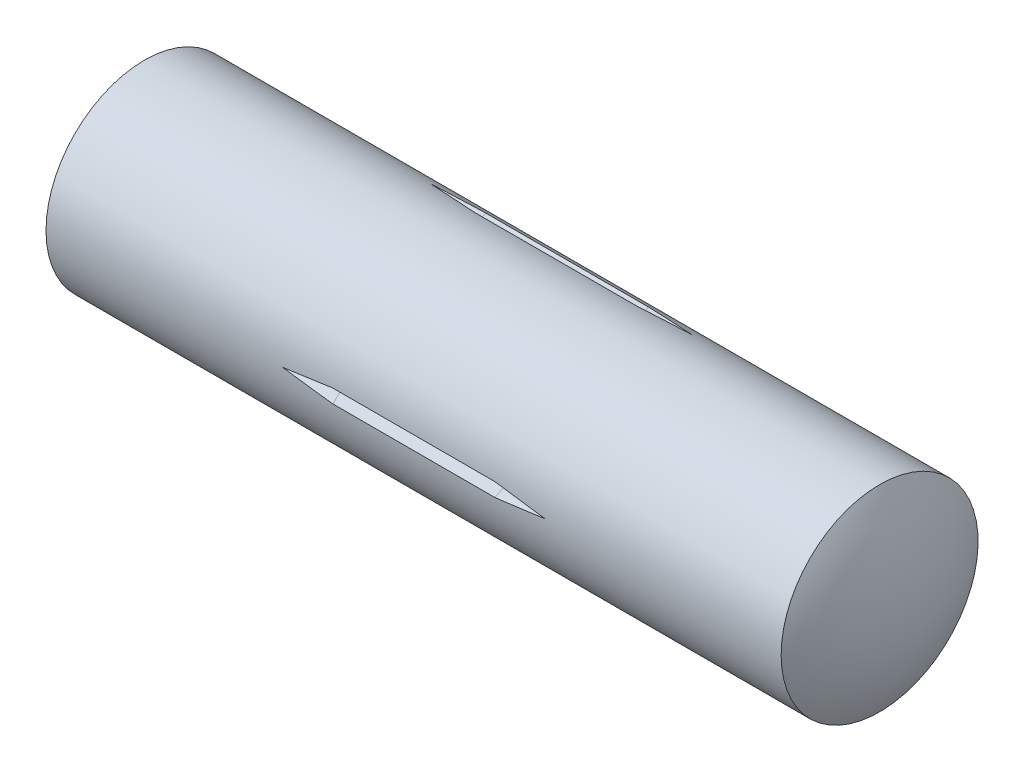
from build123d import *

# Parameters (mm, degrees)
CIRPATTERN2_COUNT = 3


with BuildPart() as part:
    # Sketch1 → Base-Revolve (revolve)
    with BuildSketch(Plane.XY):
        with BuildLine():
            Line((-50, 0), (-50, 1.25))
            ThreePointArc((-50, 1.25), (-49.010050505, 7.072345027), (-46.68190465, 12.5))
            Line((-46.68190465, 12.5), (46.650635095, 12.5))
            ThreePointArc((46.650635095, 12.5), (49.148145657, 6.470476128), (50, 0))
            Line((50, 0), (-50, 0))
        make_face()
    revolve(axis=Axis((-57, 0, 0), (1, 0, 0)))

    # Cut-Sweep3: sweep along a path in Sketch3
    with BuildLine(Plane(origin=(0, 0, 0), x_dir=(1, 0, 0), z_dir=(0, 1, 0))) as cut_sweep3_path:
        Line((-16.666666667, -12.5), (-10.416666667, -11.25))
        Line((-10.416666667, -11.25), (10.416666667, -11.25))
        Line((10.416666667, -11.25), (16.666666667, -12.5))
    # Sketch4 → Cut-Sweep3 (sweep, cut)
    with BuildSketch(Plane(origin=(-16.666666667, 0, 0), x_dir=(0, 0, -1), z_dir=(1, 0, 0))):
        Polygon((-12.5, 0), (-14.378358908, 1.315241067), (-14.378358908, -1.315241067), align=None)
    cut_sweep3 = sweep(path=cut_sweep3_path.line, transition=Transition.RIGHT, mode=Mode.SUBTRACT)

    # CirPattern2: Cut-Sweep3 ×3 about axis
    cirpattern2_axis = Axis((0, 0, 0), (1, 0, 0))
    for i in range(1, CIRPATTERN2_COUNT):
        add(cut_sweep3.rotate(cirpattern2_axis, i * 360 / CIRPATTERN2_COUNT), mode=Mode.SUBTRACT)


solid = part.part
